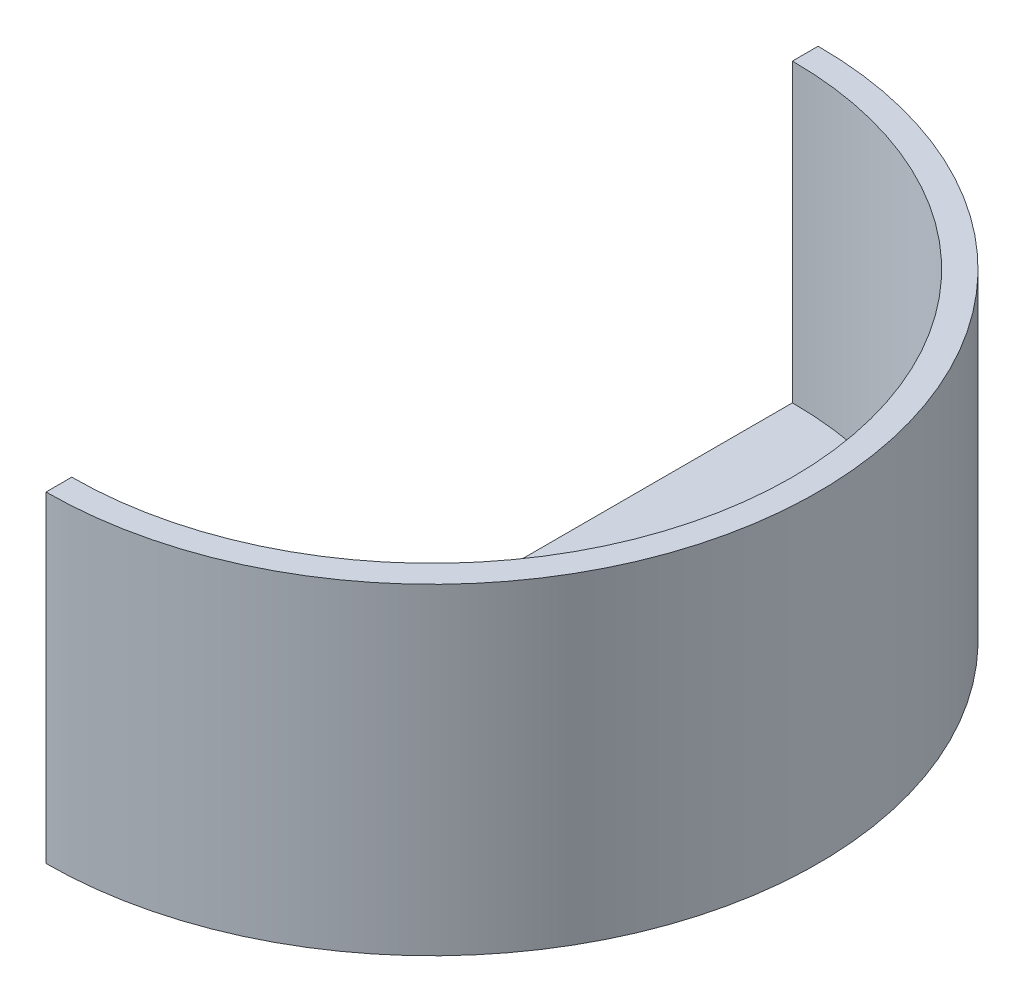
from build123d import *

# Parameters (mm, degrees)
EXTRUDE1_DEPTH = 25
SHELL1_T       = -2


with BuildPart() as part:
    # Sketch1 → Extrude1 (new body)
    with BuildSketch(Plane(origin=(0, 0, 0), x_dir=(1, 0, 0), z_dir=(0, 1, 0))):
        with BuildLine():
            Line((15, -30), (15, 30))
            ThreePointArc((15, 30), (45, 0), (15, -30))
        make_face()
    extrude(amount=EXTRUDE1_DEPTH)

    # Shell1
    shell1_openings = [part.faces().sort_by_distance(p)[0] for p in [
        (27.732395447, 25, 0),
        (15, 12.5, 0),
    ]]
    offset(amount=SHELL1_T, openings=shell1_openings)


solid = part.part
